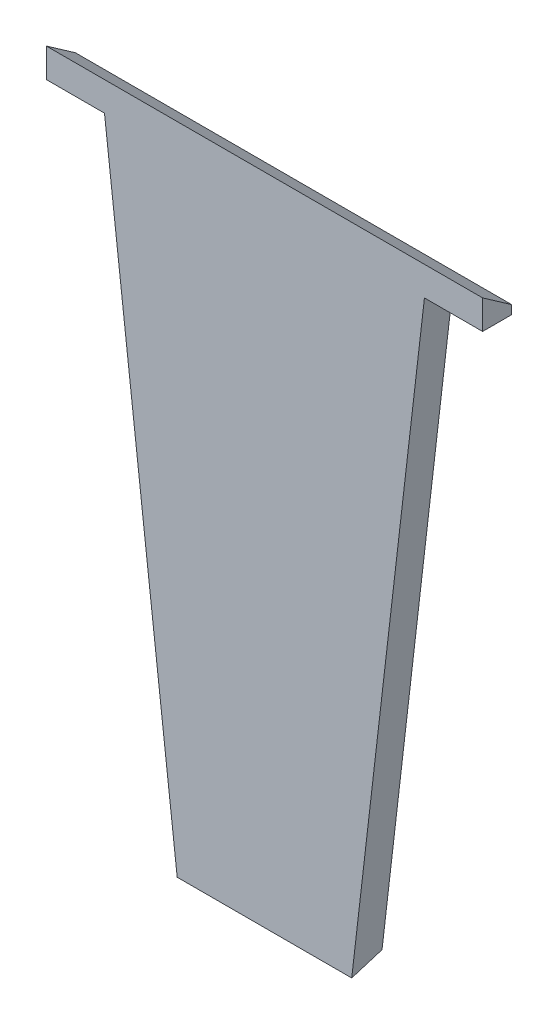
ISO-10303-21;
HEADER;
FILE_DESCRIPTION(('STEP AP214'),'2;1');
FILE_NAME('part.step','',(''),(''),'','','');
FILE_SCHEMA(('AUTOMOTIVE_DESIGN { 1 0 10303 214 1 1 1 1 }'));
ENDSEC;
DATA;
#1=APPLICATION_CONTEXT('core data for automotive mechanical design processes');
#2=APPLICATION_PROTOCOL_DEFINITION('international standard','automotive_design',2000,#1);
#3=PRODUCT_CONTEXT('',#1,'mechanical');
#4=PRODUCT('Part','Part','',(#3));
#5=PRODUCT_RELATED_PRODUCT_CATEGORY('part','',(#4));
#6=PRODUCT_DEFINITION_FORMATION('','',#4);
#7=PRODUCT_DEFINITION_CONTEXT('part definition',#1,'design');
#8=PRODUCT_DEFINITION('design','',#6,#7);
#9=PRODUCT_DEFINITION_SHAPE('','',#8);
#10=(LENGTH_UNIT() NAMED_UNIT(*) SI_UNIT(.MILLI.,.METRE.));
#11=(NAMED_UNIT(*) PLANE_ANGLE_UNIT() SI_UNIT($,.RADIAN.));
#12=(NAMED_UNIT(*) SI_UNIT($,.STERADIAN.) SOLID_ANGLE_UNIT());
#13=UNCERTAINTY_MEASURE_WITH_UNIT(LENGTH_MEASURE(1.E-05),#10,'distance_accuracy_value','');
#14=(GEOMETRIC_REPRESENTATION_CONTEXT(3) GLOBAL_UNCERTAINTY_ASSIGNED_CONTEXT((#13)) GLOBAL_UNIT_ASSIGNED_CONTEXT((#10,
#11,#12)) REPRESENTATION_CONTEXT('',''));
#15=CARTESIAN_POINT('',(0.,0.,0.));
#16=DIRECTION('',(0.,0.,1.));
#17=DIRECTION('',(1.,0.,0.));
#18=AXIS2_PLACEMENT_3D('',#15,#16,#17);
#19=CARTESIAN_POINT('',(-50.,430.,10.));
#20=DIRECTION('',(0.993307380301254,0.115500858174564,0.));
#21=DIRECTION('',(-0.115500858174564,0.993307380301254,0.));
#22=AXIS2_PLACEMENT_3D('',#19,#20,#21);
#23=PLANE('',#22);
#24=DIRECTION('',(-0.0397383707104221,0.34174998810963,-0.938950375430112));
#25=VECTOR('',#24,1.);
#26=CARTESIAN_POINT('',(-0.142124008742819,1.22226647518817,6.64185045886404));
#27=LINE('',#26,#25);
#28=CARTESIAN_POINT('',(0.,0.,10.));
#29=VERTEX_POINT('',#28);
#30=CARTESIAN_POINT('',(-0.846442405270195,7.27940468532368,-10.));
#31=VERTEX_POINT('',#30);
#32=EDGE_CURVE('E46',#29,#31,#27,.T.);
#33=ORIENTED_EDGE('',*,*,#32,.F.);
#34=DIRECTION('',(0.115500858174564,-0.993307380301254,0.));
#35=VECTOR('',#34,1.);
#36=CARTESIAN_POINT('',(-50.,430.,10.));
#37=LINE('',#36,#35);
#38=CARTESIAN_POINT('',(-50.,430.,10.));
#39=VERTEX_POINT('',#38);
#40=EDGE_CURVE('E102',#39,#29,#37,.T.);
#41=ORIENTED_EDGE('',*,*,#40,.F.);
#42=DIRECTION('',(0.,0.,-1.));
#43=VECTOR('',#42,1.);
#44=CARTESIAN_POINT('',(-50.,430.,10.));
#45=LINE('',#44,#43);
#46=CARTESIAN_POINT('',(-50.,430.,-10.));
#47=VERTEX_POINT('',#46);
#48=EDGE_CURVE('E136',#39,#47,#45,.T.);
#49=ORIENTED_EDGE('',*,*,#48,.T.);
#50=DIRECTION('',(0.115500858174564,-0.993307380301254,0.));
#51=VECTOR('',#50,1.);
#52=CARTESIAN_POINT('',(-50.,430.,-10.));
#53=LINE('',#52,#51);
#54=EDGE_CURVE('E109',#47,#31,#53,.T.);
#55=ORIENTED_EDGE('',*,*,#54,.T.);
#56=EDGE_LOOP('',(#33,#41,#49,#55));
#57=FACE_BOUND('',#56,.T.);
#58=ADVANCED_FACE('F32',(#57),#23,.F.);
#59=CARTESIAN_POINT('',(120.,0.,10.));
#60=DIRECTION('',(-0.993307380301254,0.115500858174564,0.));
#61=DIRECTION('',(-0.115500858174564,-0.993307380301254,0.));
#62=AXIS2_PLACEMENT_3D('',#59,#60,#61);
#63=PLANE('',#62);
#64=DIRECTION('',(0.0397383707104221,0.34174998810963,-0.938950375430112));
#65=VECTOR('',#64,1.);
#66=CARTESIAN_POINT('',(120.142124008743,1.22226647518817,6.64185045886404));
#67=LINE('',#66,#65);
#68=CARTESIAN_POINT('',(120.,0.,10.));
#69=VERTEX_POINT('',#68);
#70=CARTESIAN_POINT('',(120.84644240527,7.27940468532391,-10.));
#71=VERTEX_POINT('',#70);
#72=EDGE_CURVE('E97',#69,#71,#67,.T.);
#73=ORIENTED_EDGE('',*,*,#72,.T.);
#74=DIRECTION('',(0.115500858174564,0.993307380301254,0.));
#75=VECTOR('',#74,1.);
#76=CARTESIAN_POINT('',(120.,0.,-10.));
#77=LINE('',#76,#75);
#78=CARTESIAN_POINT('',(170.,430.,-10.));
#79=VERTEX_POINT('',#78);
#80=EDGE_CURVE('E138',#71,#79,#77,.T.);
#81=ORIENTED_EDGE('',*,*,#80,.T.);
#82=DIRECTION('',(0.,0.,-1.));
#83=VECTOR('',#82,1.);
#84=CARTESIAN_POINT('',(170.,430.,10.));
#85=LINE('',#84,#83);
#86=CARTESIAN_POINT('',(170.,430.,10.));
#87=VERTEX_POINT('',#86);
#88=EDGE_CURVE('E11',#87,#79,#85,.T.);
#89=ORIENTED_EDGE('',*,*,#88,.F.);
#90=DIRECTION('',(0.115500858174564,0.993307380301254,0.));
#91=VECTOR('',#90,1.);
#92=CARTESIAN_POINT('',(120.,0.,10.));
#93=LINE('',#92,#91);
#94=EDGE_CURVE('E101',#69,#87,#93,.T.);
#95=ORIENTED_EDGE('',*,*,#94,.F.);
#96=EDGE_LOOP('',(#73,#81,#89,#95));
#97=FACE_BOUND('',#96,.T.);
#98=ADVANCED_FACE('F169',(#97),#63,.F.);
#99=CARTESIAN_POINT('',(0.,0.,-10.));
#100=DIRECTION('',(0.,0.,1.));
#101=DIRECTION('',(1.,0.,0.));
#102=AXIS2_PLACEMENT_3D('',#99,#100,#101);
#103=PLANE('',#102);
#104=DIRECTION('',(-1.,0.,0.));
#105=VECTOR('',#104,1.);
#106=CARTESIAN_POINT('',(210.001,7.27940468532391,-10.));
#107=LINE('',#106,#105);
#108=EDGE_CURVE('E110',#71,#31,#107,.T.);
#109=ORIENTED_EDGE('',*,*,#108,.T.);
#110=ORIENTED_EDGE('',*,*,#54,.F.);
#111=DIRECTION('',(1.,0.,0.));
#112=VECTOR('',#111,1.);
#113=CARTESIAN_POINT('',(-90.,430.,-10.));
#114=LINE('',#113,#112);
#115=CARTESIAN_POINT('',(-90.,430.,-10.));
#116=VERTEX_POINT('',#115);
#117=EDGE_CURVE('E116',#116,#47,#114,.T.);
#118=ORIENTED_EDGE('',*,*,#117,.F.);
#119=DIRECTION('',(0.,-1.,0.));
#120=VECTOR('',#119,1.);
#121=CARTESIAN_POINT('',(-90.,450.,-10.));
#122=LINE('',#121,#120);
#123=CARTESIAN_POINT('',(-90.,435.995849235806,-9.99999999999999));
#124=VERTEX_POINT('',#123);
#125=EDGE_CURVE('E118',#124,#116,#122,.T.);
#126=ORIENTED_EDGE('',*,*,#125,.F.);
#127=DIRECTION('',(1.,0.,0.));
#128=VECTOR('',#127,1.);
#129=CARTESIAN_POINT('',(-90.001,435.995849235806,-9.99999999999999));
#130=LINE('',#129,#128);
#131=CARTESIAN_POINT('',(210.,435.995849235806,-10.));
#132=VERTEX_POINT('',#131);
#133=EDGE_CURVE('E162',#124,#132,#130,.T.);
#134=ORIENTED_EDGE('',*,*,#133,.T.);
#135=DIRECTION('',(0.,1.,0.));
#136=VECTOR('',#135,1.);
#137=CARTESIAN_POINT('',(210.,430.,-10.));
#138=LINE('',#137,#136);
#139=CARTESIAN_POINT('',(210.,430.,-10.));
#140=VERTEX_POINT('',#139);
#141=EDGE_CURVE('E142',#140,#132,#138,.T.);
#142=ORIENTED_EDGE('',*,*,#141,.F.);
#143=DIRECTION('',(1.,0.,0.));
#144=VECTOR('',#143,1.);
#145=CARTESIAN_POINT('',(170.,430.,-10.));
#146=LINE('',#145,#144);
#147=EDGE_CURVE('E140',#79,#140,#146,.T.);
#148=ORIENTED_EDGE('',*,*,#147,.F.);
#149=ORIENTED_EDGE('',*,*,#80,.F.);
#150=EDGE_LOOP('',(#109,#110,#118,#126,#134,#142,#148,#149));
#151=FACE_BOUND('',#150,.T.);
#152=ADVANCED_FACE('F159',(#151),#103,.F.);
#153=CARTESIAN_POINT('',(170.,430.,10.));
#154=DIRECTION('',(0.,1.,0.));
#155=DIRECTION('',(0.,0.,1.));
#156=AXIS2_PLACEMENT_3D('',#153,#154,#155);
#157=PLANE('',#156);
#158=ORIENTED_EDGE('',*,*,#147,.T.);
#159=DIRECTION('',(0.,0.,-1.));
#160=VECTOR('',#159,1.);
#161=CARTESIAN_POINT('',(210.,430.,10.));
#162=LINE('',#161,#160);
#163=CARTESIAN_POINT('',(210.,430.,10.));
#164=VERTEX_POINT('',#163);
#165=EDGE_CURVE('E39',#164,#140,#162,.T.);
#166=ORIENTED_EDGE('',*,*,#165,.F.);
#167=DIRECTION('',(1.,0.,0.));
#168=VECTOR('',#167,1.);
#169=CARTESIAN_POINT('',(170.,430.,10.));
#170=LINE('',#169,#168);
#171=EDGE_CURVE('E125',#87,#164,#170,.T.);
#172=ORIENTED_EDGE('',*,*,#171,.F.);
#173=ORIENTED_EDGE('',*,*,#88,.T.);
#174=EDGE_LOOP('',(#158,#166,#172,#173));
#175=FACE_BOUND('',#174,.T.);
#176=ADVANCED_FACE('F171',(#175),#157,.F.);
#177=CARTESIAN_POINT('',(210.,430.,10.));
#178=DIRECTION('',(-1.,0.,0.));
#179=DIRECTION('',(0.,0.,1.));
#180=AXIS2_PLACEMENT_3D('',#177,#178,#179);
#181=PLANE('',#180);
#182=ORIENTED_EDGE('',*,*,#141,.T.);
#183=DIRECTION('',(0.,-0.573576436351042,-0.819152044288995));
#184=VECTOR('',#183,1.);
#185=CARTESIAN_POINT('',(210.,450.,10.));
#186=LINE('',#185,#184);
#187=CARTESIAN_POINT('',(210.,450.,10.));
#188=VERTEX_POINT('',#187);
#189=EDGE_CURVE('E54',#188,#132,#186,.T.);
#190=ORIENTED_EDGE('',*,*,#189,.F.);
#191=DIRECTION('',(0.,1.,0.));
#192=VECTOR('',#191,1.);
#193=CARTESIAN_POINT('',(210.,430.,10.));
#194=LINE('',#193,#192);
#195=EDGE_CURVE('E127',#164,#188,#194,.T.);
#196=ORIENTED_EDGE('',*,*,#195,.F.);
#197=ORIENTED_EDGE('',*,*,#165,.T.);
#198=EDGE_LOOP('',(#182,#190,#196,#197));
#199=FACE_BOUND('',#198,.T.);
#200=ADVANCED_FACE('F154',(#199),#181,.F.);
#201=CARTESIAN_POINT('',(-90.,450.,10.));
#202=DIRECTION('',(1.,0.,0.));
#203=DIRECTION('',(0.,0.,-1.));
#204=AXIS2_PLACEMENT_3D('',#201,#202,#203);
#205=PLANE('',#204);
#206=DIRECTION('',(0.,-1.,0.));
#207=VECTOR('',#206,1.);
#208=CARTESIAN_POINT('',(-90.,450.,10.));
#209=LINE('',#208,#207);
#210=CARTESIAN_POINT('',(-90.,450.,10.));
#211=VERTEX_POINT('',#210);
#212=CARTESIAN_POINT('',(-90.,430.,10.));
#213=VERTEX_POINT('',#212);
#214=EDGE_CURVE('E133',#211,#213,#209,.T.);
#215=ORIENTED_EDGE('',*,*,#214,.F.);
#216=DIRECTION('',(0.,0.573576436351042,0.819152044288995));
#217=VECTOR('',#216,1.);
#218=CARTESIAN_POINT('',(-90.,450.,10.));
#219=LINE('',#218,#217);
#220=EDGE_CURVE('E121',#124,#211,#219,.T.);
#221=ORIENTED_EDGE('',*,*,#220,.F.);
#222=ORIENTED_EDGE('',*,*,#125,.T.);
#223=DIRECTION('',(0.,0.,-1.));
#224=VECTOR('',#223,1.);
#225=CARTESIAN_POINT('',(-90.,430.,10.));
#226=LINE('',#225,#224);
#227=EDGE_CURVE('E147',#213,#116,#226,.T.);
#228=ORIENTED_EDGE('',*,*,#227,.F.);
#229=EDGE_LOOP('',(#215,#221,#222,#228));
#230=FACE_BOUND('',#229,.T.);
#231=ADVANCED_FACE('F178',(#230),#205,.F.);
#232=CARTESIAN_POINT('',(-90.,430.,10.));
#233=DIRECTION('',(0.,1.,0.));
#234=DIRECTION('',(0.,0.,1.));
#235=AXIS2_PLACEMENT_3D('',#232,#233,#234);
#236=PLANE('',#235);
#237=ORIENTED_EDGE('',*,*,#117,.T.);
#238=ORIENTED_EDGE('',*,*,#48,.F.);
#239=DIRECTION('',(1.,0.,0.));
#240=VECTOR('',#239,1.);
#241=CARTESIAN_POINT('',(-90.,430.,10.));
#242=LINE('',#241,#240);
#243=EDGE_CURVE('E114',#213,#39,#242,.T.);
#244=ORIENTED_EDGE('',*,*,#243,.F.);
#245=ORIENTED_EDGE('',*,*,#227,.T.);
#246=EDGE_LOOP('',(#237,#238,#244,#245));
#247=FACE_BOUND('',#246,.T.);
#248=ADVANCED_FACE('F202',(#247),#236,.F.);
#249=CARTESIAN_POINT('',(0.,0.,10.));
#250=DIRECTION('',(0.,0.,1.));
#251=DIRECTION('',(1.,0.,0.));
#252=AXIS2_PLACEMENT_3D('',#249,#250,#251);
#253=PLANE('',#252);
#254=ORIENTED_EDGE('',*,*,#40,.T.);
#255=DIRECTION('',(1.,0.,0.));
#256=VECTOR('',#255,1.);
#257=CARTESIAN_POINT('',(0.,0.,10.));
#258=LINE('',#257,#256);
#259=EDGE_CURVE('E94',#29,#69,#258,.T.);
#260=ORIENTED_EDGE('',*,*,#259,.T.);
#261=ORIENTED_EDGE('',*,*,#94,.T.);
#262=ORIENTED_EDGE('',*,*,#171,.T.);
#263=ORIENTED_EDGE('',*,*,#195,.T.);
#264=DIRECTION('',(-1.,0.,0.));
#265=VECTOR('',#264,1.);
#266=CARTESIAN_POINT('',(210.,450.,10.));
#267=LINE('',#266,#265);
#268=EDGE_CURVE('E130',#188,#211,#267,.T.);
#269=ORIENTED_EDGE('',*,*,#268,.T.);
#270=ORIENTED_EDGE('',*,*,#214,.T.);
#271=ORIENTED_EDGE('',*,*,#243,.T.);
#272=EDGE_LOOP('',(#254,#260,#261,#262,#263,#269,#270,#271));
#273=FACE_BOUND('',#272,.T.);
#274=ADVANCED_FACE('F112',(#273),#253,.T.);
#275=CARTESIAN_POINT('',(-90.001,450.,10.));
#276=DIRECTION('',(0.,-0.819152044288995,0.573576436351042));
#277=DIRECTION('',(0.,-0.573576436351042,-0.819152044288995));
#278=AXIS2_PLACEMENT_3D('',#275,#276,#277);
#279=PLANE('',#278);
#280=ORIENTED_EDGE('',*,*,#220,.T.);
#281=ORIENTED_EDGE('',*,*,#268,.F.);
#282=ORIENTED_EDGE('',*,*,#189,.T.);
#283=ORIENTED_EDGE('',*,*,#133,.F.);
#284=EDGE_LOOP('',(#280,#281,#282,#283));
#285=FACE_BOUND('',#284,.T.);
#286=ADVANCED_FACE('F201',(#285),#279,.F.);
#287=CARTESIAN_POINT('',(210.001,0.,10.));
#288=DIRECTION('',(0.,-0.93969262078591,-0.342020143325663));
#289=DIRECTION('',(0.,0.342020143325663,-0.939692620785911));
#290=AXIS2_PLACEMENT_3D('',#287,#288,#289);
#291=PLANE('',#290);
#292=ORIENTED_EDGE('',*,*,#259,.F.);
#293=ORIENTED_EDGE('',*,*,#32,.T.);
#294=ORIENTED_EDGE('',*,*,#108,.F.);
#295=ORIENTED_EDGE('',*,*,#72,.F.);
#296=EDGE_LOOP('',(#292,#293,#294,#295));
#297=FACE_BOUND('',#296,.T.);
#298=ADVANCED_FACE('F95',(#297),#291,.T.);
#299=CLOSED_SHELL('',(#58,#98,#152,#176,#200,#231,#248,#274,#286,#298));
#300=MANIFOLD_SOLID_BREP('B2',#299);
#301=ADVANCED_BREP_SHAPE_REPRESENTATION('',(#18,#300),#14);
#302=SHAPE_DEFINITION_REPRESENTATION(#9,#301);
ENDSEC;
END-ISO-10303-21;
